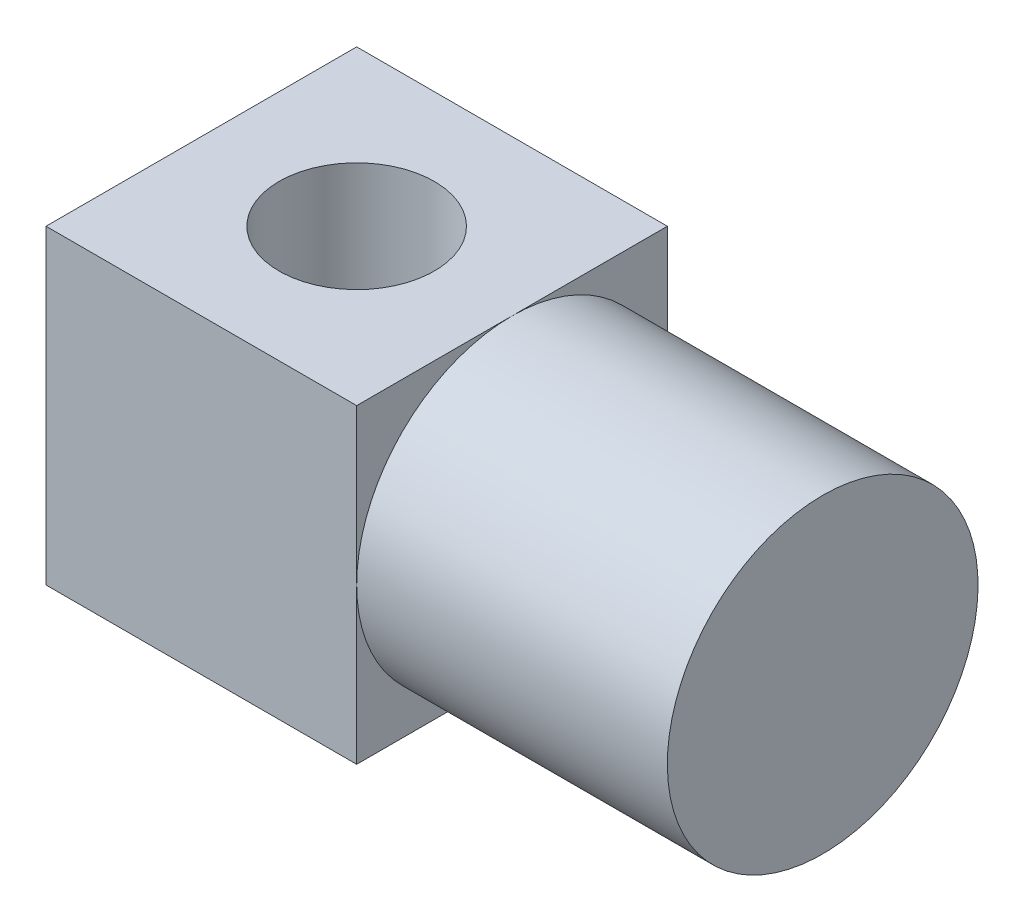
ISO-10303-21;
HEADER;
FILE_DESCRIPTION(('STEP AP214'),'2;1');
FILE_NAME('part.step','',(''),(''),'','','');
FILE_SCHEMA(('AUTOMOTIVE_DESIGN { 1 0 10303 214 1 1 1 1 }'));
ENDSEC;
DATA;
#1=APPLICATION_CONTEXT('core data for automotive mechanical design processes');
#2=APPLICATION_PROTOCOL_DEFINITION('international standard','automotive_design',2000,#1);
#3=PRODUCT_CONTEXT('',#1,'mechanical');
#4=PRODUCT('Part','Part','',(#3));
#5=PRODUCT_RELATED_PRODUCT_CATEGORY('part','',(#4));
#6=PRODUCT_DEFINITION_FORMATION('','',#4);
#7=PRODUCT_DEFINITION_CONTEXT('part definition',#1,'design');
#8=PRODUCT_DEFINITION('design','',#6,#7);
#9=PRODUCT_DEFINITION_SHAPE('','',#8);
#10=(LENGTH_UNIT() NAMED_UNIT(*) SI_UNIT(.MILLI.,.METRE.));
#11=(NAMED_UNIT(*) PLANE_ANGLE_UNIT() SI_UNIT($,.RADIAN.));
#12=(NAMED_UNIT(*) SI_UNIT($,.STERADIAN.) SOLID_ANGLE_UNIT());
#13=UNCERTAINTY_MEASURE_WITH_UNIT(LENGTH_MEASURE(1.E-05),#10,'distance_accuracy_value','');
#14=(GEOMETRIC_REPRESENTATION_CONTEXT(3) GLOBAL_UNCERTAINTY_ASSIGNED_CONTEXT((#13)) GLOBAL_UNIT_ASSIGNED_CONTEXT((#10,
#11,#12)) REPRESENTATION_CONTEXT('',''));
#15=CARTESIAN_POINT('',(0.,0.,0.));
#16=DIRECTION('',(0.,0.,1.));
#17=DIRECTION('',(1.,0.,0.));
#18=AXIS2_PLACEMENT_3D('',#15,#16,#17);
#19=CARTESIAN_POINT('',(5.,5.,-5.));
#20=DIRECTION('',(1.,0.,0.));
#21=DIRECTION('',(0.,1.,0.));
#22=AXIS2_PLACEMENT_3D('',#19,#20,#21);
#23=PLANE('',#22);
#24=CARTESIAN_POINT('',(5.,0.,0.));
#25=DIRECTION('',(1.,0.,0.));
#26=DIRECTION('',(0.,1.,0.));
#27=AXIS2_PLACEMENT_3D('',#24,#25,#26);
#28=CIRCLE('',#27,5.);
#29=CARTESIAN_POINT('',(5.,5.,0.));
#30=VERTEX_POINT('',#29);
#31=CARTESIAN_POINT('',(5.,0.,5.));
#32=VERTEX_POINT('',#31);
#33=EDGE_CURVE('E44',#30,#32,#28,.T.);
#34=ORIENTED_EDGE('',*,*,#33,.F.);
#35=DIRECTION('',(0.,0.,1.));
#36=VECTOR('',#35,1.);
#37=CARTESIAN_POINT('',(5.,5.,-5.));
#38=LINE('',#37,#36);
#39=CARTESIAN_POINT('',(5.,5.,5.));
#40=VERTEX_POINT('',#39);
#41=EDGE_CURVE('E95',#30,#40,#38,.T.);
#42=ORIENTED_EDGE('',*,*,#41,.T.);
#43=DIRECTION('',(0.,1.,0.));
#44=VECTOR('',#43,1.);
#45=CARTESIAN_POINT('',(5.,5.,5.));
#46=LINE('',#45,#44);
#47=EDGE_CURVE('E107',#32,#40,#46,.T.);
#48=ORIENTED_EDGE('',*,*,#47,.F.);
#49=EDGE_LOOP('',(#34,#42,#48));
#50=FACE_BOUND('',#49,.T.);
#51=ADVANCED_FACE('F33',(#50),#23,.T.);
#52=CARTESIAN_POINT('',(5.,-5.,0.));
#53=VERTEX_POINT('',#52);
#54=EDGE_CURVE('E11',#32,#53,#28,.T.);
#55=ORIENTED_EDGE('',*,*,#54,.F.);
#56=CARTESIAN_POINT('',(5.,-5.,5.));
#57=VERTEX_POINT('',#56);
#58=EDGE_CURVE('E123',#57,#32,#46,.T.);
#59=ORIENTED_EDGE('',*,*,#58,.F.);
#60=DIRECTION('',(0.,0.,1.));
#61=VECTOR('',#60,1.);
#62=CARTESIAN_POINT('',(5.,-5.,-5.));
#63=LINE('',#62,#61);
#64=EDGE_CURVE('E136',#53,#57,#63,.T.);
#65=ORIENTED_EDGE('',*,*,#64,.F.);
#66=EDGE_LOOP('',(#55,#59,#65));
#67=FACE_BOUND('',#66,.T.);
#68=ADVANCED_FACE('F148',(#67),#23,.T.);
#69=CARTESIAN_POINT('',(5.,0.,-5.));
#70=VERTEX_POINT('',#69);
#71=EDGE_CURVE('E42',#53,#70,#28,.T.);
#72=ORIENTED_EDGE('',*,*,#71,.F.);
#73=CARTESIAN_POINT('',(5.,-5.,-5.));
#74=VERTEX_POINT('',#73);
#75=EDGE_CURVE('E105',#74,#53,#63,.T.);
#76=ORIENTED_EDGE('',*,*,#75,.F.);
#77=DIRECTION('',(0.,1.,0.));
#78=VECTOR('',#77,1.);
#79=CARTESIAN_POINT('',(5.,5.,-5.));
#80=LINE('',#79,#78);
#81=EDGE_CURVE('E132',#74,#70,#80,.T.);
#82=ORIENTED_EDGE('',*,*,#81,.T.);
#83=EDGE_LOOP('',(#72,#76,#82));
#84=FACE_BOUND('',#83,.T.);
#85=ADVANCED_FACE('F150',(#84),#23,.T.);
#86=CARTESIAN_POINT('',(-5.,5.,-5.));
#87=DIRECTION('',(-1.,0.,0.));
#88=DIRECTION('',(0.,0.,1.));
#89=AXIS2_PLACEMENT_3D('',#86,#87,#88);
#90=PLANE('',#89);
#91=DIRECTION('',(0.,0.,1.));
#92=VECTOR('',#91,1.);
#93=CARTESIAN_POINT('',(-5.,-5.,-5.));
#94=LINE('',#93,#92);
#95=CARTESIAN_POINT('',(-5.,-5.,-5.));
#96=VERTEX_POINT('',#95);
#97=CARTESIAN_POINT('',(-5.,-5.,5.));
#98=VERTEX_POINT('',#97);
#99=EDGE_CURVE('E37',#96,#98,#94,.T.);
#100=ORIENTED_EDGE('',*,*,#99,.T.);
#101=DIRECTION('',(0.,-1.,0.));
#102=VECTOR('',#101,1.);
#103=CARTESIAN_POINT('',(-5.,5.,5.));
#104=LINE('',#103,#102);
#105=CARTESIAN_POINT('',(-5.,5.,5.));
#106=VERTEX_POINT('',#105);
#107=EDGE_CURVE('E117',#106,#98,#104,.T.);
#108=ORIENTED_EDGE('',*,*,#107,.F.);
#109=DIRECTION('',(0.,0.,1.));
#110=VECTOR('',#109,1.);
#111=CARTESIAN_POINT('',(-5.,5.,-5.));
#112=LINE('',#111,#110);
#113=CARTESIAN_POINT('',(-5.,5.,-5.));
#114=VERTEX_POINT('',#113);
#115=EDGE_CURVE('E94',#114,#106,#112,.T.);
#116=ORIENTED_EDGE('',*,*,#115,.F.);
#117=DIRECTION('',(0.,-1.,0.));
#118=VECTOR('',#117,1.);
#119=CARTESIAN_POINT('',(-5.,5.,-5.));
#120=LINE('',#119,#118);
#121=EDGE_CURVE('E126',#114,#96,#120,.T.);
#122=ORIENTED_EDGE('',*,*,#121,.T.);
#123=EDGE_LOOP('',(#100,#108,#116,#122));
#124=FACE_BOUND('',#123,.T.);
#125=ADVANCED_FACE('F35',(#124),#90,.T.);
#126=CARTESIAN_POINT('',(5.,5.,-5.));
#127=DIRECTION('',(0.,1.,0.));
#128=DIRECTION('',(-1.,0.,0.));
#129=AXIS2_PLACEMENT_3D('',#126,#127,#128);
#130=PLANE('',#129);
#131=CARTESIAN_POINT('',(0.,5.,0.));
#132=DIRECTION('',(0.,1.,0.));
#133=DIRECTION('',(-1.,0.,0.));
#134=AXIS2_PLACEMENT_3D('',#131,#132,#133);
#135=CIRCLE('',#134,2.5);
#136=CARTESIAN_POINT('',(-2.5,5.,0.));
#137=VERTEX_POINT('',#136);
#138=EDGE_CURVE('E169',#137,#137,#135,.T.);
#139=ORIENTED_EDGE('',*,*,#138,.F.);
#140=EDGE_LOOP('',(#139));
#141=FACE_BOUND('',#140,.T.);
#142=ORIENTED_EDGE('',*,*,#115,.T.);
#143=DIRECTION('',(-1.,0.,0.));
#144=VECTOR('',#143,1.);
#145=CARTESIAN_POINT('',(5.,5.,5.));
#146=LINE('',#145,#144);
#147=EDGE_CURVE('E102',#40,#106,#146,.T.);
#148=ORIENTED_EDGE('',*,*,#147,.F.);
#149=ORIENTED_EDGE('',*,*,#41,.F.);
#150=CARTESIAN_POINT('',(5.,5.,-5.));
#151=VERTEX_POINT('',#150);
#152=EDGE_CURVE('E87',#151,#30,#38,.T.);
#153=ORIENTED_EDGE('',*,*,#152,.F.);
#154=DIRECTION('',(-1.,0.,0.));
#155=VECTOR('',#154,1.);
#156=CARTESIAN_POINT('',(5.,5.,-5.));
#157=LINE('',#156,#155);
#158=EDGE_CURVE('E134',#151,#114,#157,.T.);
#159=ORIENTED_EDGE('',*,*,#158,.T.);
#160=EDGE_LOOP('',(#142,#148,#149,#153,#159));
#161=FACE_BOUND('',#160,.T.);
#162=ADVANCED_FACE('F100',(#141,#161),#130,.T.);
#163=EDGE_CURVE('E51',#70,#30,#28,.T.);
#164=ORIENTED_EDGE('',*,*,#163,.F.);
#165=EDGE_CURVE('E90',#70,#151,#80,.T.);
#166=ORIENTED_EDGE('',*,*,#165,.T.);
#167=ORIENTED_EDGE('',*,*,#152,.T.);
#168=EDGE_LOOP('',(#164,#166,#167));
#169=FACE_BOUND('',#168,.T.);
#170=ADVANCED_FACE('F89',(#169),#23,.T.);
#171=CARTESIAN_POINT('',(5.,-5.,-5.));
#172=DIRECTION('',(0.,-1.,0.));
#173=DIRECTION('',(1.,0.,0.));
#174=AXIS2_PLACEMENT_3D('',#171,#172,#173);
#175=PLANE('',#174);
#176=CARTESIAN_POINT('',(0.,-5.,0.));
#177=DIRECTION('',(0.,1.,0.));
#178=DIRECTION('',(-1.,0.,0.));
#179=AXIS2_PLACEMENT_3D('',#176,#177,#178);
#180=CIRCLE('',#179,2.5);
#181=CARTESIAN_POINT('',(-2.5,-5.,0.));
#182=VERTEX_POINT('',#181);
#183=EDGE_CURVE('E111',#182,#182,#180,.T.);
#184=ORIENTED_EDGE('',*,*,#183,.T.);
#185=EDGE_LOOP('',(#184));
#186=FACE_BOUND('',#185,.T.);
#187=ORIENTED_EDGE('',*,*,#75,.T.);
#188=ORIENTED_EDGE('',*,*,#64,.T.);
#189=DIRECTION('',(1.,0.,0.));
#190=VECTOR('',#189,1.);
#191=CARTESIAN_POINT('',(5.,-5.,5.));
#192=LINE('',#191,#190);
#193=EDGE_CURVE('E120',#98,#57,#192,.T.);
#194=ORIENTED_EDGE('',*,*,#193,.F.);
#195=ORIENTED_EDGE('',*,*,#99,.F.);
#196=DIRECTION('',(1.,0.,0.));
#197=VECTOR('',#196,1.);
#198=CARTESIAN_POINT('',(5.,-5.,-5.));
#199=LINE('',#198,#197);
#200=EDGE_CURVE('E129',#96,#74,#199,.T.);
#201=ORIENTED_EDGE('',*,*,#200,.T.);
#202=EDGE_LOOP('',(#187,#188,#194,#195,#201));
#203=FACE_BOUND('',#202,.T.);
#204=ADVANCED_FACE('F143',(#186,#203),#175,.T.);
#205=CARTESIAN_POINT('',(0.,0.,-5.));
#206=DIRECTION('',(0.,0.,-1.));
#207=DIRECTION('',(-1.,0.,0.));
#208=AXIS2_PLACEMENT_3D('',#205,#206,#207);
#209=PLANE('',#208);
#210=ORIENTED_EDGE('',*,*,#121,.F.);
#211=ORIENTED_EDGE('',*,*,#158,.F.);
#212=ORIENTED_EDGE('',*,*,#165,.F.);
#213=ORIENTED_EDGE('',*,*,#81,.F.);
#214=ORIENTED_EDGE('',*,*,#200,.F.);
#215=EDGE_LOOP('',(#210,#211,#212,#213,#214));
#216=FACE_BOUND('',#215,.T.);
#217=ADVANCED_FACE('F160',(#216),#209,.T.);
#218=CARTESIAN_POINT('',(0.,0.,5.));
#219=DIRECTION('',(0.,0.,-1.));
#220=DIRECTION('',(-1.,0.,0.));
#221=AXIS2_PLACEMENT_3D('',#218,#219,#220);
#222=PLANE('',#221);
#223=ORIENTED_EDGE('',*,*,#107,.T.);
#224=ORIENTED_EDGE('',*,*,#193,.T.);
#225=ORIENTED_EDGE('',*,*,#58,.T.);
#226=ORIENTED_EDGE('',*,*,#47,.T.);
#227=ORIENTED_EDGE('',*,*,#147,.T.);
#228=EDGE_LOOP('',(#223,#224,#225,#226,#227));
#229=FACE_BOUND('',#228,.T.);
#230=ADVANCED_FACE('F146',(#229),#222,.F.);
#231=CARTESIAN_POINT('',(15.,0.,0.));
#232=DIRECTION('',(-1.,0.,0.));
#233=DIRECTION('',(0.,-1.,0.));
#234=AXIS2_PLACEMENT_3D('',#231,#232,#233);
#235=CYLINDRICAL_SURFACE('',#234,5.);
#236=CARTESIAN_POINT('',(15.,0.,0.));
#237=DIRECTION('',(1.,0.,0.));
#238=DIRECTION('',(0.,1.,0.));
#239=AXIS2_PLACEMENT_3D('',#236,#237,#238);
#240=CIRCLE('',#239,5.);
#241=CARTESIAN_POINT('',(15.,5.,0.));
#242=VERTEX_POINT('',#241);
#243=EDGE_CURVE('E110',#242,#242,#240,.T.);
#244=ORIENTED_EDGE('',*,*,#243,.F.);
#245=EDGE_LOOP('',(#244));
#246=FACE_BOUND('',#245,.T.);
#247=ORIENTED_EDGE('',*,*,#33,.T.);
#248=ORIENTED_EDGE('',*,*,#54,.T.);
#249=ORIENTED_EDGE('',*,*,#71,.T.);
#250=ORIENTED_EDGE('',*,*,#163,.T.);
#251=EDGE_LOOP('',(#247,#248,#249,#250));
#252=FACE_BOUND('',#251,.T.);
#253=ADVANCED_FACE('F112',(#246,#252),#235,.T.);
#254=CARTESIAN_POINT('',(15.,0.,0.));
#255=DIRECTION('',(1.,0.,0.));
#256=DIRECTION('',(0.,1.,0.));
#257=AXIS2_PLACEMENT_3D('',#254,#255,#256);
#258=PLANE('',#257);
#259=ORIENTED_EDGE('',*,*,#243,.T.);
#260=EDGE_LOOP('',(#259));
#261=FACE_BOUND('',#260,.T.);
#262=ADVANCED_FACE('F220',(#261),#258,.T.);
#263=CARTESIAN_POINT('',(0.,-5.,0.));
#264=DIRECTION('',(0.,1.,0.));
#265=DIRECTION('',(-1.,0.,0.));
#266=AXIS2_PLACEMENT_3D('',#263,#264,#265);
#267=CYLINDRICAL_SURFACE('',#266,2.5);
#268=ORIENTED_EDGE('',*,*,#183,.F.);
#269=EDGE_LOOP('',(#268));
#270=FACE_BOUND('',#269,.T.);
#271=ORIENTED_EDGE('',*,*,#138,.T.);
#272=EDGE_LOOP('',(#271));
#273=FACE_BOUND('',#272,.T.);
#274=ADVANCED_FACE('F174',(#270,#273),#267,.F.);
#275=CLOSED_SHELL('',(#51,#68,#85,#125,#162,#170,#204,#217,#230,#253,#262,#274));
#276=MANIFOLD_SOLID_BREP('B2',#275);
#277=ADVANCED_BREP_SHAPE_REPRESENTATION('',(#18,#276),#14);
#278=SHAPE_DEFINITION_REPRESENTATION(#9,#277);
ENDSEC;
END-ISO-10303-21;
